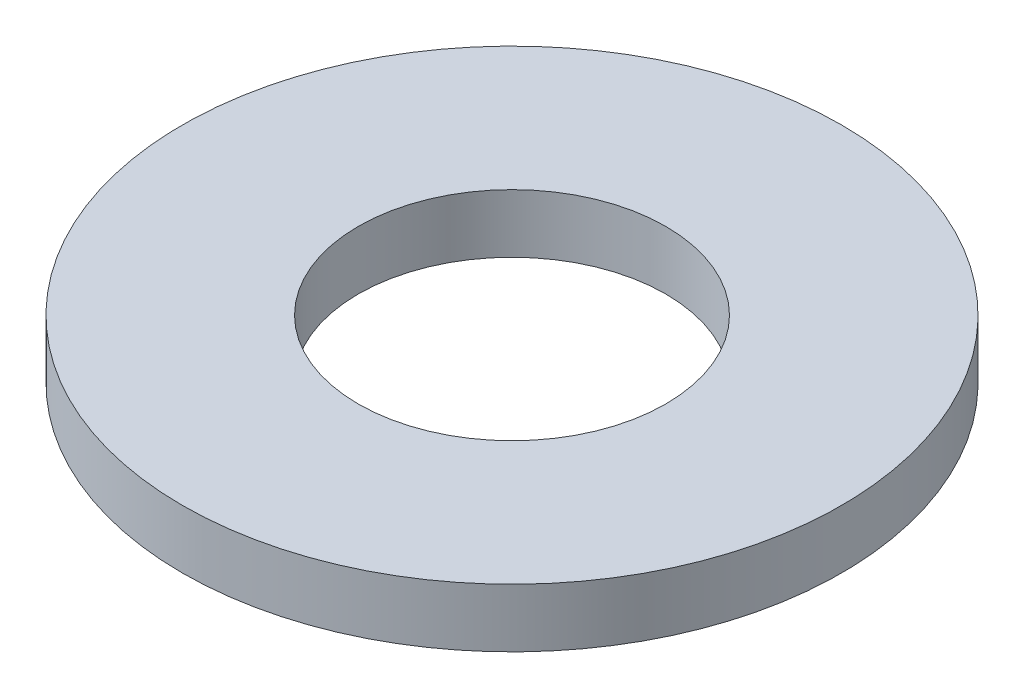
ISO-10303-21;
HEADER;
FILE_DESCRIPTION(('STEP AP214'),'2;1');
FILE_NAME('part.step','',(''),(''),'','','');
FILE_SCHEMA(('AUTOMOTIVE_DESIGN { 1 0 10303 214 1 1 1 1 }'));
ENDSEC;
DATA;
#1=APPLICATION_CONTEXT('core data for automotive mechanical design processes');
#2=APPLICATION_PROTOCOL_DEFINITION('international standard','automotive_design',2000,#1);
#3=PRODUCT_CONTEXT('',#1,'mechanical');
#4=PRODUCT('Part','Part','',(#3));
#5=PRODUCT_RELATED_PRODUCT_CATEGORY('part','',(#4));
#6=PRODUCT_DEFINITION_FORMATION('','',#4);
#7=PRODUCT_DEFINITION_CONTEXT('part definition',#1,'design');
#8=PRODUCT_DEFINITION('design','',#6,#7);
#9=PRODUCT_DEFINITION_SHAPE('','',#8);
#10=(LENGTH_UNIT() NAMED_UNIT(*) SI_UNIT(.MILLI.,.METRE.));
#11=(NAMED_UNIT(*) PLANE_ANGLE_UNIT() SI_UNIT($,.RADIAN.));
#12=(NAMED_UNIT(*) SI_UNIT($,.STERADIAN.) SOLID_ANGLE_UNIT());
#13=UNCERTAINTY_MEASURE_WITH_UNIT(LENGTH_MEASURE(1.E-05),#10,'distance_accuracy_value','');
#14=(GEOMETRIC_REPRESENTATION_CONTEXT(3) GLOBAL_UNCERTAINTY_ASSIGNED_CONTEXT((#13)) GLOBAL_UNIT_ASSIGNED_CONTEXT((#10,
#11,#12)) REPRESENTATION_CONTEXT('',''));
#15=CARTESIAN_POINT('',(0.,0.,0.));
#16=DIRECTION('',(0.,0.,1.));
#17=DIRECTION('',(1.,0.,0.));
#18=AXIS2_PLACEMENT_3D('',#15,#16,#17);
#19=CARTESIAN_POINT('',(0.,0.8,0.));
#20=DIRECTION('',(0.,1.,0.));
#21=DIRECTION('',(0.,0.,1.));
#22=AXIS2_PLACEMENT_3D('',#19,#20,#21);
#23=PLANE('',#22);
#24=CARTESIAN_POINT('',(0.,0.8,0.));
#25=DIRECTION('',(0.,1.,0.));
#26=DIRECTION('',(0.,0.,1.));
#27=AXIS2_PLACEMENT_3D('',#24,#25,#26);
#28=CIRCLE('',#27,4.5);
#29=CARTESIAN_POINT('',(0.,0.8,4.5));
#30=VERTEX_POINT('',#29);
#31=EDGE_CURVE('E10',#30,#30,#28,.T.);
#32=ORIENTED_EDGE('',*,*,#31,.T.);
#33=EDGE_LOOP('',(#32));
#34=FACE_BOUND('',#33,.T.);
#35=CARTESIAN_POINT('',(0.,0.8,0.));
#36=DIRECTION('',(0.,1.,0.));
#37=DIRECTION('',(0.,0.,1.));
#38=AXIS2_PLACEMENT_3D('',#35,#36,#37);
#39=CIRCLE('',#38,2.1);
#40=CARTESIAN_POINT('',(0.,0.8,2.1));
#41=VERTEX_POINT('',#40);
#42=EDGE_CURVE('E42',#41,#41,#39,.T.);
#43=ORIENTED_EDGE('',*,*,#42,.F.);
#44=EDGE_LOOP('',(#43));
#45=FACE_BOUND('',#44,.T.);
#46=ADVANCED_FACE('F31',(#34,#45),#23,.T.);
#47=CARTESIAN_POINT('',(0.,0.,0.));
#48=DIRECTION('',(0.,1.,0.));
#49=DIRECTION('',(0.,0.,1.));
#50=AXIS2_PLACEMENT_3D('',#47,#48,#49);
#51=PLANE('',#50);
#52=CARTESIAN_POINT('',(0.,0.,0.));
#53=DIRECTION('',(0.,1.,0.));
#54=DIRECTION('',(0.,0.,1.));
#55=AXIS2_PLACEMENT_3D('',#52,#53,#54);
#56=CIRCLE('',#55,4.5);
#57=CARTESIAN_POINT('',(0.,0.,4.5));
#58=VERTEX_POINT('',#57);
#59=EDGE_CURVE('E35',#58,#58,#56,.T.);
#60=ORIENTED_EDGE('',*,*,#59,.F.);
#61=EDGE_LOOP('',(#60));
#62=FACE_BOUND('',#61,.T.);
#63=CARTESIAN_POINT('',(0.,0.,0.));
#64=DIRECTION('',(0.,1.,0.));
#65=DIRECTION('',(0.,0.,1.));
#66=AXIS2_PLACEMENT_3D('',#63,#64,#65);
#67=CIRCLE('',#66,2.1);
#68=CARTESIAN_POINT('',(0.,0.,2.1));
#69=VERTEX_POINT('',#68);
#70=EDGE_CURVE('E44',#69,#69,#67,.T.);
#71=ORIENTED_EDGE('',*,*,#70,.T.);
#72=EDGE_LOOP('',(#71));
#73=FACE_BOUND('',#72,.T.);
#74=ADVANCED_FACE('F54',(#62,#73),#51,.F.);
#75=CARTESIAN_POINT('',(0.,0.8,0.));
#76=DIRECTION('',(0.,-1.,0.));
#77=DIRECTION('',(0.,0.,-1.));
#78=AXIS2_PLACEMENT_3D('',#75,#76,#77);
#79=CYLINDRICAL_SURFACE('',#78,4.5);
#80=ORIENTED_EDGE('',*,*,#31,.F.);
#81=EDGE_LOOP('',(#80));
#82=FACE_BOUND('',#81,.T.);
#83=ORIENTED_EDGE('',*,*,#59,.T.);
#84=EDGE_LOOP('',(#83));
#85=FACE_BOUND('',#84,.T.);
#86=ADVANCED_FACE('F33',(#82,#85),#79,.T.);
#87=CARTESIAN_POINT('',(0.,0.8,0.));
#88=DIRECTION('',(0.,-1.,0.));
#89=DIRECTION('',(0.,0.,-1.));
#90=AXIS2_PLACEMENT_3D('',#87,#88,#89);
#91=CYLINDRICAL_SURFACE('',#90,2.1);
#92=ORIENTED_EDGE('',*,*,#42,.T.);
#93=EDGE_LOOP('',(#92));
#94=FACE_BOUND('',#93,.T.);
#95=ORIENTED_EDGE('',*,*,#70,.F.);
#96=EDGE_LOOP('',(#95));
#97=FACE_BOUND('',#96,.T.);
#98=ADVANCED_FACE('F50',(#94,#97),#91,.F.);
#99=CLOSED_SHELL('',(#46,#74,#86,#98));
#100=MANIFOLD_SOLID_BREP('B2',#99);
#101=ADVANCED_BREP_SHAPE_REPRESENTATION('',(#18,#100),#14);
#102=SHAPE_DEFINITION_REPRESENTATION(#9,#101);
ENDSEC;
END-ISO-10303-21;
